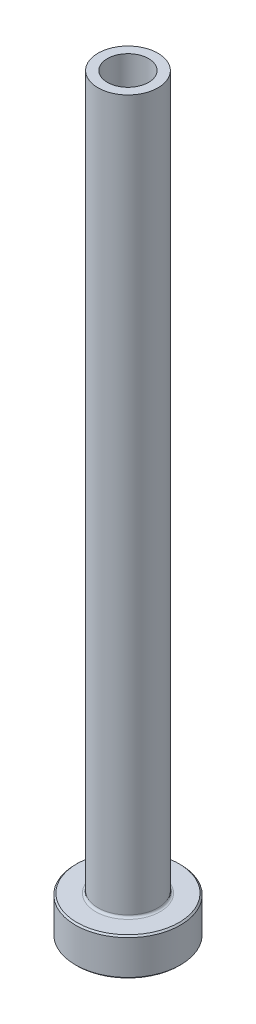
from build123d import *

# Parameters (mm, degrees)
FILLET1_R     = 0.3
CHAMFER1_SIZE = 0.2
CHAMFER3_SIZE = 0.5


with BuildPart() as part:
    # Sketch1 → Revolve1 (revolve)
    with BuildSketch(Plane.XY, mode=Mode.PRIVATE) as revolve1_sk:
        Polygon((-2.75, 100), (-4, 100), (-4, 5), (-7, 5), (-7, 0), (-3, 0), (-3, 43), (-2.75, 55), align=None)
    revolve(revolve1_sk.sketch.rotate(Axis((0, 92.187680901, 0), (0, -1, 0)), 270), axis=Axis((0, 92.187680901, 0), (0, -1, 0)))

    # Fillet1
    fillet1_edges = [part.edges().sort_by_distance(p)[0] for p in [
        (0, 5, -4),
    ]]
    fillet(fillet1_edges, radius=FILLET1_R)

    # Chamfer1
    chamfer1_edges = [part.edges().sort_by_distance(p)[0] for p in [
        (0, 0, -7),
        (0, 5, -7),
    ]]
    chamfer(chamfer1_edges, length=CHAMFER1_SIZE)

    # Chamfer3
    chamfer3_edges = [part.edges().sort_by_distance(p)[0] for p in [
        (0, 0, -3),
    ]]
    chamfer(chamfer3_edges, length=CHAMFER3_SIZE)


solid = part.part
